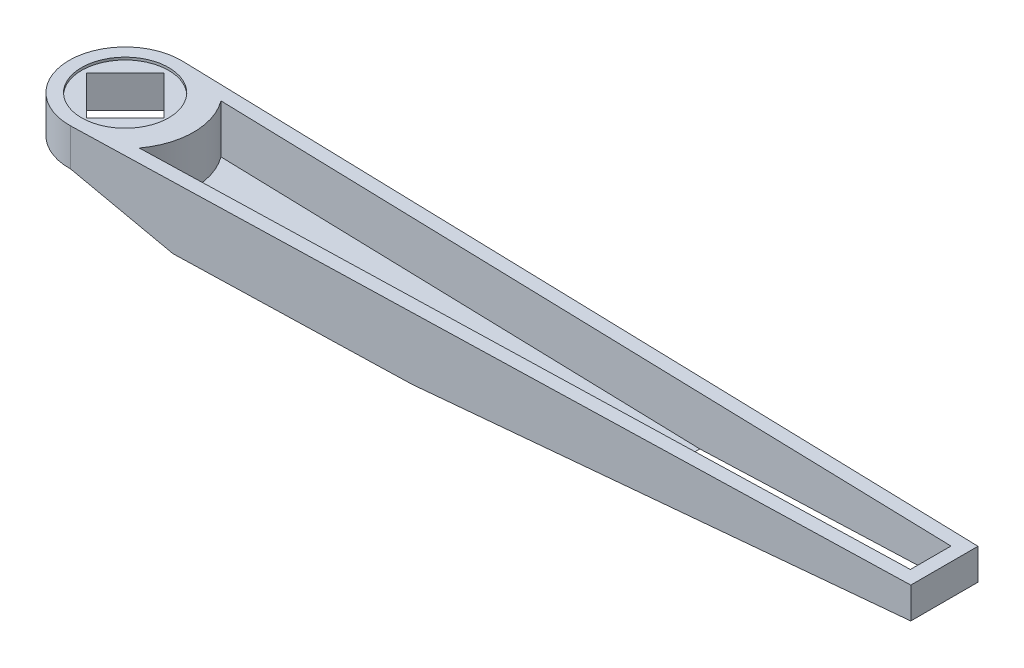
from build123d import *

# Parameters (mm, degrees)
EXTRUDE_X1_DEPTH          = 25
CUT_EXTRUDE_X2_DEPTH      = 331.714182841
CUT_EXTRUDE_X2_DEPTH_BACK = 331.714182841
CUT_EXTRUDE2_DEPTH        = 333.392290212
CUT_EXTRUDE2_DEPTH_BACK   = 333.392290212
SKETCH_C_R                = 22.5
EXTRUDE_X3_DEPTH          = 15
SKETCH4_R                 = 17.5
CUT_EXTRUDE3_DEPTH        = 1
CUT_EXTRUDE4_DEPTH        = 331.714756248
CUT_EXTRUDE5_START        = -1
SKETCH7_R                 = 17.5
CUT_EXTRUDE5_DEPTH        = 1
CUT_EXTRUDE7_DEPTH        = 19.5


with BuildPart() as part:
    # Sketch A → Extrude X1 (new body)
    with BuildSketch(Plane(origin=(0, 0, 0), x_dir=(1, 0, 0), z_dir=(0, 1, 0))):
        Polygon((0.615847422, 22.491570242), (329, 13.5), (329, -13.5), (0.615847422, -22.491570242), align=None)
    extrude(amount=EXTRUDE_X1_DEPTH)

    # Sketch B → Cut-Extrude X2 (cut, two sides: drawn at the far end of the back side and taken through both)
    with BuildSketch(Plane.XY.offset(-CUT_EXTRUDE_X2_DEPTH_BACK)):
        Polygon((329, 12.5), (134, 0), (134, -74.146668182), (362.466184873, -74.146668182), (356.911911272, 12.5), align=None)
    extrude(amount=CUT_EXTRUDE_X2_DEPTH + CUT_EXTRUDE_X2_DEPTH_BACK, mode=Mode.SUBTRACT)

    # Sketch3 → Cut-Extrude2 (cut, two sides: drawn at the far end of the back side and taken through both)
    with BuildSketch(Plane(origin=(0.615847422, 0, 22.491570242), x_dir=(0.9996253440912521, 0, -0.02737099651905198), z_dir=(0.02737099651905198, 0, 0.9996253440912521)).offset(-CUT_EXTRUDE2_DEPTH_BACK)):
        Polygon((-649.672635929, 172.418158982), (0, 10), (40, 0), (689.672635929, -162.418158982), (364.836317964, -1461.76343084), (-974.508953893, -1126.927112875), align=None)
    extrude(amount=CUT_EXTRUDE2_DEPTH + CUT_EXTRUDE2_DEPTH_BACK, mode=Mode.SUBTRACT)

    # Sketch C → Extrude X3 (add)
    with BuildSketch(Plane(origin=(0, 25, 0), x_dir=(1, 0, 0), z_dir=(0, 1, 0))):
        Circle(SKETCH_C_R)
    extrude(amount=-EXTRUDE_X3_DEPTH)

    # Sketch4 → Cut-Extrude3 (cut)
    with BuildSketch(Plane(origin=(0, 25, 0), x_dir=(1, 0, 0), z_dir=(0, 1, 0))):
        with Locations(Location((0, 0, 0), (0, 0, 270))):
            Circle(SKETCH4_R)
    extrude(amount=-CUT_EXTRUDE3_DEPTH, mode=Mode.SUBTRACT)

    # Sketch6 → Cut-Extrude4 (cut, through all)
    with BuildSketch(Plane(origin=(0, 25, 0), x_dir=(1, 0, 0), z_dir=(0, 1, 0))):
        Polygon((0, 15.556349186), (-15.556349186, 0), (0, -15.556349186), (15.556349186, 0), align=None)
    extrude(amount=-CUT_EXTRUDE4_DEPTH, mode=Mode.SUBTRACT)

    # Sketch7 → Cut-Extrude5 (cut)
    with BuildSketch(Plane.XZ.offset(-10).offset(CUT_EXTRUDE5_START)):
        with Locations(Location((0, 0, 0), (0, 0, 90))):
            Circle(SKETCH7_R)
    extrude(amount=CUT_EXTRUDE5_DEPTH, mode=Mode.SUBTRACT)

    # Sketch10 → Cut-Extrude7 (cut)
    with BuildSketch(Plane(origin=(0, 25, 0), x_dir=(1, 0, 0), z_dir=(0, 1, 0))):
        with BuildLine():
            Line((22.073174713, 16.401980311), (323.5, 8.148535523))
            Line((323.5, 8.148535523), (323.5, -8.148535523))
            Line((323.5, -8.148535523), (22.073174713, -16.401980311))
            ThreePointArc((22.073174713, -16.401980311), (27.5, 0), (22.073174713, 16.401980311))
        make_face()
    extrude(amount=-CUT_EXTRUDE7_DEPTH, mode=Mode.SUBTRACT)


solid = part.part
